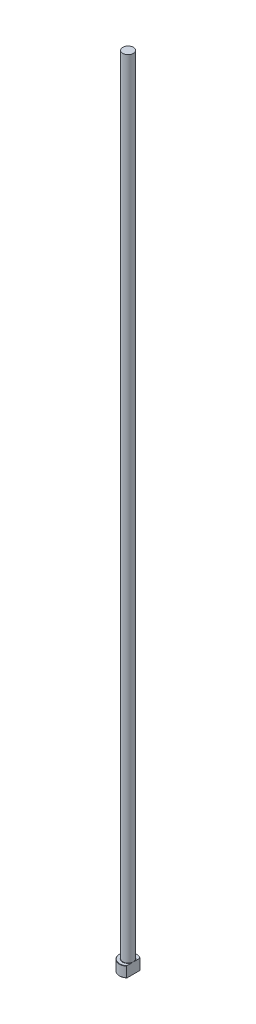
ISO-10303-21;
HEADER;
FILE_DESCRIPTION(('STEP AP214'),'2;1');
FILE_NAME('part.step','',(''),(''),'','','');
FILE_SCHEMA(('AUTOMOTIVE_DESIGN { 1 0 10303 214 1 1 1 1 }'));
ENDSEC;
DATA;
#1=APPLICATION_CONTEXT('core data for automotive mechanical design processes');
#2=APPLICATION_PROTOCOL_DEFINITION('international standard','automotive_design',2000,#1);
#3=PRODUCT_CONTEXT('',#1,'mechanical');
#4=PRODUCT('Part','Part','',(#3));
#5=PRODUCT_RELATED_PRODUCT_CATEGORY('part','',(#4));
#6=PRODUCT_DEFINITION_FORMATION('','',#4);
#7=PRODUCT_DEFINITION_CONTEXT('part definition',#1,'design');
#8=PRODUCT_DEFINITION('design','',#6,#7);
#9=PRODUCT_DEFINITION_SHAPE('','',#8);
#10=(LENGTH_UNIT() NAMED_UNIT(*) SI_UNIT(.MILLI.,.METRE.));
#11=(NAMED_UNIT(*) PLANE_ANGLE_UNIT() SI_UNIT($,.RADIAN.));
#12=(NAMED_UNIT(*) SI_UNIT($,.STERADIAN.) SOLID_ANGLE_UNIT());
#13=UNCERTAINTY_MEASURE_WITH_UNIT(LENGTH_MEASURE(1.E-05),#10,'distance_accuracy_value','');
#14=(GEOMETRIC_REPRESENTATION_CONTEXT(3) GLOBAL_UNCERTAINTY_ASSIGNED_CONTEXT((#13)) GLOBAL_UNIT_ASSIGNED_CONTEXT((#10,
#11,#12)) REPRESENTATION_CONTEXT('',''));
#15=CARTESIAN_POINT('',(0.,0.,0.));
#16=DIRECTION('',(0.,0.,1.));
#17=DIRECTION('',(1.,0.,0.));
#18=AXIS2_PLACEMENT_3D('',#15,#16,#17);
#19=CARTESIAN_POINT('',(0.,0.,0.));
#20=DIRECTION('',(0.,-1.,0.));
#21=DIRECTION('',(0.,0.,-1.));
#22=AXIS2_PLACEMENT_3D('',#19,#20,#21);
#23=PLANE('',#22);
#24=CARTESIAN_POINT('',(0.,0.,0.));
#25=DIRECTION('',(0.,-1.,0.));
#26=DIRECTION('',(0.,0.,-1.));
#27=AXIS2_PLACEMENT_3D('',#24,#25,#26);
#28=CIRCLE('',#27,6.29999999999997);
#29=CARTESIAN_POINT('',(3.99999999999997,0.,4.86723740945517));
#30=VERTEX_POINT('',#29);
#31=CARTESIAN_POINT('',(3.99999999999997,0.,-4.86723740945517));
#32=VERTEX_POINT('',#31);
#33=EDGE_CURVE('E98',#30,#32,#28,.T.);
#34=ORIENTED_EDGE('',*,*,#33,.T.);
#35=DIRECTION('',(0.,0.,1.));
#36=VECTOR('',#35,1.);
#37=CARTESIAN_POINT('',(3.99999999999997,0.,5.12347538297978));
#38=LINE('',#37,#36);
#39=EDGE_CURVE('E83',#32,#30,#38,.T.);
#40=ORIENTED_EDGE('',*,*,#39,.T.);
#41=EDGE_LOOP('',(#34,#40));
#42=FACE_BOUND('',#41,.T.);
#43=ADVANCED_FACE('F32',(#42),#23,.T.);
#44=CARTESIAN_POINT('',(0.,259.958771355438,0.));
#45=DIRECTION('',(0.,1.,0.));
#46=DIRECTION('',(0.,0.,1.));
#47=AXIS2_PLACEMENT_3D('',#44,#45,#46);
#48=CYLINDRICAL_SURFACE('',#47,6.49999999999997);
#49=CARTESIAN_POINT('',(0.,7.79999999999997,0.));
#50=DIRECTION('',(0.,1.,0.));
#51=DIRECTION('',(0.,0.,1.));
#52=AXIS2_PLACEMENT_3D('',#49,#50,#51);
#53=CIRCLE('',#52,6.49999999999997);
#54=CARTESIAN_POINT('',(3.99999999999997,7.79999999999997,5.12347538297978));
#55=VERTEX_POINT('',#54);
#56=CARTESIAN_POINT('',(3.99999999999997,7.79999999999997,-5.12347538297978));
#57=VERTEX_POINT('',#56);
#58=EDGE_CURVE('E104',#55,#57,#53,.F.);
#59=ORIENTED_EDGE('',*,*,#58,.T.);
#60=DIRECTION('',(0.,-1.,0.));
#61=VECTOR('',#60,1.);
#62=CARTESIAN_POINT('',(3.99999999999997,600.,-5.12347538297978));
#63=LINE('',#62,#61);
#64=CARTESIAN_POINT('',(3.99999999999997,0.200000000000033,-5.12347538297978));
#65=VERTEX_POINT('',#64);
#66=EDGE_CURVE('E183',#57,#65,#63,.T.);
#67=ORIENTED_EDGE('',*,*,#66,.T.);
#68=CARTESIAN_POINT('',(0.,0.200000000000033,0.));
#69=DIRECTION('',(0.,-1.,0.));
#70=DIRECTION('',(0.,0.,-1.));
#71=AXIS2_PLACEMENT_3D('',#68,#69,#70);
#72=CIRCLE('',#71,6.49999999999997);
#73=CARTESIAN_POINT('',(3.99999999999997,0.200000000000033,5.12347538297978));
#74=VERTEX_POINT('',#73);
#75=EDGE_CURVE('E100',#65,#74,#72,.F.);
#76=ORIENTED_EDGE('',*,*,#75,.T.);
#77=DIRECTION('',(0.,-1.,0.));
#78=VECTOR('',#77,1.);
#79=CARTESIAN_POINT('',(3.99999999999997,600.,5.12347538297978));
#80=LINE('',#79,#78);
#81=EDGE_CURVE('E93',#55,#74,#80,.T.);
#82=ORIENTED_EDGE('',*,*,#81,.F.);
#83=EDGE_LOOP('',(#59,#67,#76,#82));
#84=FACE_BOUND('',#83,.T.);
#85=ADVANCED_FACE('F158',(#84),#48,.T.);
#86=CARTESIAN_POINT('',(-6.49999999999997,8.,0.));
#87=DIRECTION('',(0.,1.,0.));
#88=DIRECTION('',(0.,0.,1.));
#89=AXIS2_PLACEMENT_3D('',#86,#87,#88);
#90=PLANE('',#89);
#91=CARTESIAN_POINT('',(0.,8.,0.));
#92=DIRECTION('',(0.,1.,0.));
#93=DIRECTION('',(0.,0.,1.));
#94=AXIS2_PLACEMENT_3D('',#91,#92,#93);
#95=CIRCLE('',#94,6.29999999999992);
#96=CARTESIAN_POINT('',(3.99999999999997,8.,-4.86723740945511));
#97=VERTEX_POINT('',#96);
#98=CARTESIAN_POINT('',(3.99999999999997,8.,4.86723740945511));
#99=VERTEX_POINT('',#98);
#100=EDGE_CURVE('E178',#97,#99,#95,.T.);
#101=ORIENTED_EDGE('',*,*,#100,.T.);
#102=DIRECTION('',(0.,0.,-1.));
#103=VECTOR('',#102,1.);
#104=CARTESIAN_POINT('',(3.99999999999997,8.,0.));
#105=LINE('',#104,#103);
#106=CARTESIAN_POINT('',(3.99999999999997,7.99999999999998,1.28062484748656));
#107=VERTEX_POINT('',#106);
#108=EDGE_CURVE('E57',#99,#107,#105,.T.);
#109=ORIENTED_EDGE('',*,*,#108,.T.);
#110=CARTESIAN_POINT('',(0.,8.,0.));
#111=DIRECTION('',(0.,1.,0.));
#112=DIRECTION('',(0.,0.,1.));
#113=AXIS2_PLACEMENT_3D('',#110,#111,#112);
#114=CIRCLE('',#113,4.19999999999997);
#115=CARTESIAN_POINT('',(3.99999999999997,7.99999999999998,-1.28062484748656));
#116=VERTEX_POINT('',#115);
#117=EDGE_CURVE('E107',#107,#116,#114,.F.);
#118=ORIENTED_EDGE('',*,*,#117,.T.);
#119=EDGE_CURVE('E136',#116,#97,#105,.T.);
#120=ORIENTED_EDGE('',*,*,#119,.T.);
#121=EDGE_LOOP('',(#101,#109,#118,#120));
#122=FACE_BOUND('',#121,.T.);
#123=ADVANCED_FACE('F147',(#122),#90,.T.);
#124=CARTESIAN_POINT('',(0.,8.00000000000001,0.));
#125=DIRECTION('',(0.,-1.,0.));
#126=DIRECTION('',(0.,0.,-1.));
#127=AXIS2_PLACEMENT_3D('',#124,#125,#126);
#128=CONICAL_SURFACE('',#127,6.29999999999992,0.785398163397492);
#129=ORIENTED_EDGE('',*,*,#58,.F.);
#130=CARTESIAN_POINT('',(3.99999999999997,2.33835680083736,11.2730168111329));
#131=CARTESIAN_POINT('',(3.99999999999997,2.50751109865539,11.0935258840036));
#132=CARTESIAN_POINT('',(3.99999999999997,2.6764300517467,10.9138129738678));
#133=CARTESIAN_POINT('',(3.99999999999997,3.01371694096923,10.5538688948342));
#134=CARTESIAN_POINT('',(3.99999999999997,3.18208487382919,10.3736377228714));
#135=CARTESIAN_POINT('',(3.99999999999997,3.68651578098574,9.83176085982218));
#136=CARTESIAN_POINT('',(3.99999999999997,4.02162663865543,9.46922758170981));
#137=CARTESIAN_POINT('',(3.99999999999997,4.6983926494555,8.73004878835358));
#138=CARTESIAN_POINT('',(3.99999999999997,5.03994227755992,8.35330632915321));
#139=CARTESIAN_POINT('',(3.99999999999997,5.54813444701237,7.78474717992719));
#140=CARTESIAN_POINT('',(3.99999999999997,5.71678224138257,7.59472329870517));
#141=CARTESIAN_POINT('',(3.99999999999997,6.05243048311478,7.21322727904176));
#142=CARTESIAN_POINT('',(3.99999999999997,6.21943094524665,7.02175515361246));
#143=CARTESIAN_POINT('',(3.99999999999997,6.55125779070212,6.63720143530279));
#144=CARTESIAN_POINT('',(3.99999999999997,6.71608581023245,6.44412125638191));
#145=CARTESIAN_POINT('',(3.99999999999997,7.04317390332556,6.05578163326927));
#146=CARTESIAN_POINT('',(3.99999999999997,7.20543388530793,5.86052211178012));
#147=CARTESIAN_POINT('',(3.99999999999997,7.52702721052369,5.46681806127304));
#148=CARTESIAN_POINT('',(3.99999999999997,7.68635259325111,5.26836701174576));
#149=CARTESIAN_POINT('',(3.99999999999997,8.00060742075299,4.86803282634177));
#150=CARTESIAN_POINT('',(3.99999999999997,8.15553731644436,4.66615004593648));
#151=CARTESIAN_POINT('',(3.99999999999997,8.45751575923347,4.26060182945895));
#152=CARTESIAN_POINT('',(3.99999999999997,8.60464039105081,4.05699334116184));
#153=CARTESIAN_POINT('',(3.99999999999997,8.89099959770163,3.64409822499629));
#154=CARTESIAN_POINT('',(3.99999999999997,9.03023022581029,3.43480883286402));
#155=CARTESIAN_POINT('',(3.99999999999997,9.29677357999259,3.00991388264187));
#156=CARTESIAN_POINT('',(3.99999999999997,9.42413322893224,2.79433803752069));
#157=CARTESIAN_POINT('',(3.99999999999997,9.66227069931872,2.35430355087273));
#158=CARTESIAN_POINT('',(3.99999999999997,9.77306978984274,2.12985677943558));
#159=CARTESIAN_POINT('',(3.99999999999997,9.92324174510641,1.77981866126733));
#160=CARTESIAN_POINT('',(3.99999999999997,9.97150219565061,1.65804958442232));
#161=CARTESIAN_POINT('',(3.99999999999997,10.0598239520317,1.41150602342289));
#162=CARTESIAN_POINT('',(3.99999999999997,10.099883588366,1.28673093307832));
#163=CARTESIAN_POINT('',(3.99999999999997,10.1699893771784,1.03512545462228));
#164=CARTESIAN_POINT('',(3.99999999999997,10.2000910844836,0.908310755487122));
#165=CARTESIAN_POINT('',(3.99999999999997,10.2490705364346,0.652511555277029));
#166=CARTESIAN_POINT('',(3.99999999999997,10.2679495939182,0.523527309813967));
#167=CARTESIAN_POINT('',(3.99999999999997,10.2934980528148,0.262809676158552));
#168=CARTESIAN_POINT('',(3.99999999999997,10.3000223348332,0.131061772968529));
#169=CARTESIAN_POINT('',(3.99999999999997,10.2999775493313,-0.132423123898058));
#170=CARTESIAN_POINT('',(3.99999999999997,10.2934092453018,-0.264160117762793));
#171=CARTESIAN_POINT('',(3.99999999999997,10.2675780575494,-0.526867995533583));
#172=CARTESIAN_POINT('',(3.99999999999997,10.2482669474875,-0.657834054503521));
#173=CARTESIAN_POINT('',(3.99999999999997,10.1980980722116,-0.917527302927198));
#174=CARTESIAN_POINT('',(3.99999999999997,10.1672371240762,-1.04625386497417));
#175=CARTESIAN_POINT('',(3.99999999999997,10.0805844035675,-1.35405733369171));
#176=CARTESIAN_POINT('',(3.99999999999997,10.0197633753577,-1.5317103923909));
#177=CARTESIAN_POINT('',(3.99999999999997,9.88274788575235,-1.88095872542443));
#178=CARTESIAN_POINT('',(3.99999999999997,9.80654370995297,-2.0525500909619));
#179=CARTESIAN_POINT('',(3.99999999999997,9.68319777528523,-2.30659899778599));
#180=CARTESIAN_POINT('',(3.99999999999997,9.64031955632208,-2.39117275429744));
#181=CARTESIAN_POINT('',(3.99999999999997,9.55202002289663,-2.55898629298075));
#182=CARTESIAN_POINT('',(3.99999999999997,9.50659867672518,-2.642226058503));
#183=CARTESIAN_POINT('',(3.99999999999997,9.41358656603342,-2.80743574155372));
#184=CARTESIAN_POINT('',(3.99999999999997,9.36599667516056,-2.8894061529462));
#185=CARTESIAN_POINT('',(3.99999999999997,9.26892422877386,-3.05220990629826));
#186=CARTESIAN_POINT('',(3.99999999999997,9.2194417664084,-3.13304330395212));
#187=CARTESIAN_POINT('',(3.99999999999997,9.04529267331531,-3.41112924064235));
#188=CARTESIAN_POINT('',(3.99999999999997,8.91648308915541,-3.60579191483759));
#189=CARTESIAN_POINT('',(3.99999999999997,8.6517561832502,-3.99024288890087));
#190=CARTESIAN_POINT('',(3.99999999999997,8.51583685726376,-4.18002979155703));
#191=CARTESIAN_POINT('',(3.99999999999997,8.23863283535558,-4.55590680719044));
#192=CARTESIAN_POINT('',(3.99999999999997,8.09734319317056,-4.74199325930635));
#193=CARTESIAN_POINT('',(3.99999999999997,7.81082146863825,-5.11106130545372));
#194=CARTESIAN_POINT('',(3.99999999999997,7.66558980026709,-5.29404322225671));
#195=CARTESIAN_POINT('',(3.99999999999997,7.37148704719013,-5.65825720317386));
#196=CARTESIAN_POINT('',(3.99999999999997,7.22260377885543,-5.83947940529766));
#197=CARTESIAN_POINT('',(3.99999999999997,6.92240731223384,-6.19990198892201));
#198=CARTESIAN_POINT('',(3.99999999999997,6.77109406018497,-6.3791023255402));
#199=CARTESIAN_POINT('',(3.99999999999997,6.3144319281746,-6.91404380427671));
#200=CARTESIAN_POINT('',(3.99999999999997,6.00619978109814,-7.26732233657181));
#201=CARTESIAN_POINT('',(3.99999999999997,5.42019779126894,-7.92915827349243));
#202=CARTESIAN_POINT('',(3.99999999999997,5.14297898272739,-8.23820650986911));
#203=CARTESIAN_POINT('',(3.99999999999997,4.58554936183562,-8.85367584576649));
#204=CARTESIAN_POINT('',(3.99999999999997,4.30533810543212,-9.16009654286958));
#205=CARTESIAN_POINT('',(3.99999999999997,3.74491435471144,-9.76850943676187));
#206=CARTESIAN_POINT('',(3.99999999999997,3.46471907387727,-10.0705175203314));
#207=CARTESIAN_POINT('',(3.99999999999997,2.90267484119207,-10.6728856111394));
#208=CARTESIAN_POINT('',(3.99999999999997,2.6208262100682,-10.9732459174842));
#209=CARTESIAN_POINT('',(3.99999999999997,2.33835680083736,-11.2730168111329));
#210=B_SPLINE_CURVE_WITH_KNOTS('',3,(#130,#131,#132,#133,#134,#135,#136,#137,#138,#139,#140,
#141,#142,#143,#144,#145,#146,#147,#148,#149,#150,#151,#152,#153,#154,#155,#156,#157,#158,#159,
#160,#161,#162,#163,#164,#165,#166,#167,#168,#169,#170,#171,#172,#173,#174,#175,#176,#177,#178,
#179,#180,#181,#182,#183,#184,#185,#186,#187,#188,#189,#190,#191,#192,#193,#194,#195,#196,#197,
#198,#199,#200,#201,#202,#203,#204,#205,#206,#207,#208,#209),.UNSPECIFIED.,.F.,.F.,(4,2,2,2,2,2,
2,2,2,2,2,2,2,2,2,2,2,2,2,2,2,2,2,2,2,2,2,2,2,2,2,2,2,2,2,2,2,2,2,4),(0.,0.739913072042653,
1.47983052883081,2.96088564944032,4.486400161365,5.24860048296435,6.0107939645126,
6.77237616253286,7.53398545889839,8.29742301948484,9.06078197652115,9.8142547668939,
10.5681010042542,11.3188284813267,12.0685833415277,12.4613034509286,12.854103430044,
13.2446735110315,13.6351978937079,14.0302815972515,14.4253422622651,14.8219067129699,
15.218580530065,15.7809161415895,16.3436079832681,16.6280404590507,16.9124764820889,
17.1967989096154,17.481107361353,18.1811169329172,18.8813249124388,19.5821942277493,
20.2829902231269,20.9865751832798,21.6901757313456,23.0966141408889,24.3420866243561,
25.5877465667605,26.8236460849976,28.0593133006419),.UNSPECIFIED.);
#211=EDGE_CURVE('E135',#55,#99,#210,.T.);
#212=ORIENTED_EDGE('',*,*,#211,.T.);
#213=ORIENTED_EDGE('',*,*,#100,.F.);
#214=EDGE_CURVE('E127',#97,#57,#210,.T.);
#215=ORIENTED_EDGE('',*,*,#214,.T.);
#216=EDGE_LOOP('',(#129,#212,#213,#215));
#217=FACE_BOUND('',#216,.T.);
#218=ADVANCED_FACE('F143',(#217),#128,.T.);
#219=CARTESIAN_POINT('',(0.,0.200000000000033,0.));
#220=DIRECTION('',(0.,1.,0.));
#221=DIRECTION('',(0.,0.,1.));
#222=AXIS2_PLACEMENT_3D('',#219,#220,#221);
#223=CONICAL_SURFACE('',#222,6.49999999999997,0.785398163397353);
#224=ORIENTED_EDGE('',*,*,#75,.F.);
#225=CARTESIAN_POINT('',(3.99999999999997,5.66164319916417,-11.2730168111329));
#226=CARTESIAN_POINT('',(3.99999999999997,5.4924889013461,-11.0935258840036));
#227=CARTESIAN_POINT('',(3.99999999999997,5.32356994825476,-10.9138129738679));
#228=CARTESIAN_POINT('',(3.99999999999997,4.98628305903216,-10.5538688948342));
#229=CARTESIAN_POINT('',(3.99999999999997,4.81791512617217,-10.3736377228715));
#230=CARTESIAN_POINT('',(3.99999999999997,4.31348421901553,-9.8317608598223));
#231=CARTESIAN_POINT('',(3.99999999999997,3.97837336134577,-9.46922758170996));
#232=CARTESIAN_POINT('',(3.99999999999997,3.30160735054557,-8.7300487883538));
#233=CARTESIAN_POINT('',(3.99999999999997,2.96005772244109,-8.35330632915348));
#234=CARTESIAN_POINT('',(3.99999999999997,2.45186555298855,-7.78474717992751));
#235=CARTESIAN_POINT('',(3.99999999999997,2.28321775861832,-7.59472329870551));
#236=CARTESIAN_POINT('',(3.99999999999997,1.94756951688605,-7.21322727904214));
#237=CARTESIAN_POINT('',(3.99999999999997,1.78056905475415,-7.02175515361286));
#238=CARTESIAN_POINT('',(3.99999999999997,1.44874220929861,-6.63720143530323));
#239=CARTESIAN_POINT('',(3.99999999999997,1.28391418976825,-6.44412125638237));
#240=CARTESIAN_POINT('',(3.99999999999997,0.95682609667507,-6.05578163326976));
#241=CARTESIAN_POINT('',(3.99999999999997,0.794566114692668,-5.86052211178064));
#242=CARTESIAN_POINT('',(3.99999999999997,0.472972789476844,-5.4668180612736));
#243=CARTESIAN_POINT('',(3.99999999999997,0.313647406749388,-5.26836701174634));
#244=CARTESIAN_POINT('',(3.99999999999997,-0.000607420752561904,-4.86803282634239));
#245=CARTESIAN_POINT('',(3.99999999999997,-0.155537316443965,-4.66615004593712));
#246=CARTESIAN_POINT('',(3.99999999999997,-0.457515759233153,-4.26060182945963));
#247=CARTESIAN_POINT('',(3.99999999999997,-0.604640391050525,-4.05699334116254));
#248=CARTESIAN_POINT('',(3.99999999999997,-0.890999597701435,-3.64409822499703));
#249=CARTESIAN_POINT('',(3.99999999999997,-1.03023022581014,-3.43480883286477));
#250=CARTESIAN_POINT('',(3.99999999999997,-1.29677357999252,-3.00991388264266));
#251=CARTESIAN_POINT('',(3.99999999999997,-1.42413322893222,-2.7943380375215));
#252=CARTESIAN_POINT('',(3.99999999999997,-1.6622706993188,-2.35430355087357));
#253=CARTESIAN_POINT('',(3.99999999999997,-1.77306978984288,-2.12985677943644));
#254=CARTESIAN_POINT('',(3.99999999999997,-1.92324174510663,-1.77981866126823));
#255=CARTESIAN_POINT('',(3.99999999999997,-1.97150219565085,-1.65804958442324));
#256=CARTESIAN_POINT('',(3.99999999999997,-2.05982395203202,-1.41150602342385));
#257=CARTESIAN_POINT('',(3.99999999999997,-2.09988358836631,-1.2867309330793));
#258=CARTESIAN_POINT('',(3.99999999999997,-2.16998937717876,-1.0351254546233));
#259=CARTESIAN_POINT('',(3.99999999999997,-2.20009108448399,-0.908310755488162));
#260=CARTESIAN_POINT('',(3.99999999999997,-2.24907053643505,-0.652511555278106));
#261=CARTESIAN_POINT('',(3.99999999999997,-2.26794959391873,-0.523527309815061));
#262=CARTESIAN_POINT('',(3.99999999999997,-2.29349805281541,-0.262809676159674));
#263=CARTESIAN_POINT('',(3.99999999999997,-2.30002233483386,-0.131061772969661));
#264=CARTESIAN_POINT('',(3.99999999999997,-2.29997754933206,0.13242312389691));
#265=CARTESIAN_POINT('',(3.99999999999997,-2.29340924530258,0.264160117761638));
#266=CARTESIAN_POINT('',(3.99999999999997,-2.26757805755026,0.526867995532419));
#267=CARTESIAN_POINT('',(3.99999999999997,-2.24826694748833,0.657834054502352));
#268=CARTESIAN_POINT('',(3.99999999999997,-2.19809807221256,0.917527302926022));
#269=CARTESIAN_POINT('',(3.99999999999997,-2.16723712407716,1.04625386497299));
#270=CARTESIAN_POINT('',(3.99999999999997,-2.08058440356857,1.35405733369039));
#271=CARTESIAN_POINT('',(3.99999999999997,-2.01976337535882,1.53171039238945));
#272=CARTESIAN_POINT('',(3.99999999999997,-1.88274788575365,1.88095872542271));
#273=CARTESIAN_POINT('',(3.99999999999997,-1.80654370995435,2.05255009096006));
#274=CARTESIAN_POINT('',(3.99999999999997,-1.68319777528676,2.30659899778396));
#275=CARTESIAN_POINT('',(3.99999999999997,-1.64031955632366,2.39117275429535));
#276=CARTESIAN_POINT('',(3.99999999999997,-1.55202002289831,2.55898629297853));
#277=CARTESIAN_POINT('',(3.99999999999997,-1.5065986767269,2.64222605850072));
#278=CARTESIAN_POINT('',(3.99999999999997,-1.41358656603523,2.80743574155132));
#279=CARTESIAN_POINT('',(3.99999999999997,-1.36599667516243,2.88940615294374));
#280=CARTESIAN_POINT('',(3.99999999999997,-1.26892422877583,3.05220990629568));
#281=CARTESIAN_POINT('',(3.99999999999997,-1.21944176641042,3.13304330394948));
#282=CARTESIAN_POINT('',(3.99999999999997,-1.04529267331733,3.41112924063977));
#283=CARTESIAN_POINT('',(3.99999999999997,-0.916483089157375,3.60579191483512));
#284=CARTESIAN_POINT('',(3.99999999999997,-0.651756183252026,3.99024288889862));
#285=CARTESIAN_POINT('',(3.99999999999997,-0.515836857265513,4.18002979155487));
#286=CARTESIAN_POINT('',(3.99999999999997,-0.23863283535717,4.55590680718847));
#287=CARTESIAN_POINT('',(3.99999999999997,-0.0973431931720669,4.74199325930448));
#288=CARTESIAN_POINT('',(3.99999999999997,0.189178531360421,5.11106130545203));
#289=CARTESIAN_POINT('',(3.99999999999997,0.334410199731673,5.2940432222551));
#290=CARTESIAN_POINT('',(3.99999999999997,0.628512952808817,5.65825720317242));
#291=CARTESIAN_POINT('',(3.99999999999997,0.777396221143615,5.83947940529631));
#292=CARTESIAN_POINT('',(3.99999999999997,1.07759268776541,6.19990198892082));
#293=CARTESIAN_POINT('',(3.99999999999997,1.22890593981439,6.37910232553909));
#294=CARTESIAN_POINT('',(3.99999999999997,1.68556807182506,6.91404380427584));
#295=CARTESIAN_POINT('',(3.99999999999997,1.99380021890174,7.26732233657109));
#296=CARTESIAN_POINT('',(3.99999999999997,2.57980220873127,7.92915827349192));
#297=CARTESIAN_POINT('',(3.99999999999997,2.85702101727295,8.23820650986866));
#298=CARTESIAN_POINT('',(3.99999999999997,3.41445063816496,8.85367584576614));
#299=CARTESIAN_POINT('',(3.99999999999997,3.69466189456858,9.16009654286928));
#300=CARTESIAN_POINT('',(3.99999999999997,4.2550856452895,9.76850943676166));
#301=CARTESIAN_POINT('',(3.99999999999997,4.53528092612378,10.0705175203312));
#302=CARTESIAN_POINT('',(3.99999999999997,5.09732515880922,10.6728856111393));
#303=CARTESIAN_POINT('',(3.99999999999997,5.37917378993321,10.9732459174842));
#304=CARTESIAN_POINT('',(3.99999999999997,5.66164319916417,11.2730168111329));
#305=B_SPLINE_CURVE_WITH_KNOTS('',3,(#225,#226,#227,#228,#229,#230,#231,#232,#233,#234,#235,
#236,#237,#238,#239,#240,#241,#242,#243,#244,#245,#246,#247,#248,#249,#250,#251,#252,#253,#254,
#255,#256,#257,#258,#259,#260,#261,#262,#263,#264,#265,#266,#267,#268,#269,#270,#271,#272,#273,
#274,#275,#276,#277,#278,#279,#280,#281,#282,#283,#284,#285,#286,#287,#288,#289,#290,#291,#292,
#293,#294,#295,#296,#297,#298,#299,#300,#301,#302,#303,#304),.UNSPECIFIED.,.F.,.F.,(4,2,2,2,2,2,
2,2,2,2,2,2,2,2,2,2,2,2,2,2,2,2,2,2,2,2,2,2,2,2,2,2,2,2,2,2,2,2,2,4),(0.,0.739913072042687,
1.47983052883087,2.96088564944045,4.48640016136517,5.24860048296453,6.0107939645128,
6.77237616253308,7.53398545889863,8.29742301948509,9.06078197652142,9.81425476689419,
10.5681010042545,11.3188284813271,12.0685833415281,12.4613034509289,12.8541034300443,
13.2446735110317,13.6351978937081,14.0302815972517,14.4253422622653,14.8219067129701,
15.2185805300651,15.7809161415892,16.3436079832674,16.6280404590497,16.9124764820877,
17.196798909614,17.4811073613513,18.1811169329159,18.8813249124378,19.5821942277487,
20.2829902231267,20.98657518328,21.6901757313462,23.0966141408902,24.3420866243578,
25.5877465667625,26.823646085,28.0593133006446),.UNSPECIFIED.);
#306=EDGE_CURVE('E86',#65,#32,#305,.T.);
#307=ORIENTED_EDGE('',*,*,#306,.T.);
#308=ORIENTED_EDGE('',*,*,#33,.F.);
#309=EDGE_CURVE('E89',#30,#74,#305,.T.);
#310=ORIENTED_EDGE('',*,*,#309,.T.);
#311=EDGE_LOOP('',(#224,#307,#308,#310));
#312=FACE_BOUND('',#311,.T.);
#313=ADVANCED_FACE('F97',(#312),#223,.T.);
#314=CARTESIAN_POINT('',(0.,8.19999999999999,0.));
#315=DIRECTION('',(0.,1.,0.));
#316=DIRECTION('',(0.,0.,1.));
#317=AXIS2_PLACEMENT_3D('',#314,#315,#316);
#318=TOROIDAL_SURFACE('',#317,4.19999999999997,0.2);
#319=CARTESIAN_POINT('',(3.99999999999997,8.19999999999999,0.));
#320=CARTESIAN_POINT('',(3.99999999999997,8.20000051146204,6.54993054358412E-12));
#321=CARTESIAN_POINT('',(3.99999999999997,8.20000102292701,-2.33849533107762E-07));
#322=CARTESIAN_POINT('',(3.99999999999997,8.20000197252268,-8.59106931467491E-07));
#323=CARTESIAN_POINT('',(3.99999999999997,8.20000239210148,-1.26721109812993E-06));
#324=CARTESIAN_POINT('',(3.99999999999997,8.20000328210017,-2.25074280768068E-06));
#325=CARTESIAN_POINT('',(3.99999999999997,8.20000373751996,-2.84212519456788E-06));
#326=CARTESIAN_POINT('',(3.99999999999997,8.20000453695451,-4.05328052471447E-06));
#327=CARTESIAN_POINT('',(3.99999999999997,8.20000488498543,-4.67066382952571E-06));
#328=CARTESIAN_POINT('',(3.99999999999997,8.20000621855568,-7.11716611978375E-06));
#329=CARTESIAN_POINT('',(3.99999999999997,8.20000713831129,-8.98558487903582E-06));
#330=CARTESIAN_POINT('',(3.99999999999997,8.20000861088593,-1.26418243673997E-05));
#331=CARTESIAN_POINT('',(3.99999999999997,8.2000091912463,-1.44189480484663E-05));
#332=CARTESIAN_POINT('',(3.99999999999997,8.20001169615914,-2.20915838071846E-05));
#333=CARTESIAN_POINT('',(3.99999999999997,8.20001361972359,-2.79894750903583E-05));
#334=CARTESIAN_POINT('',(3.99999999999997,8.20001638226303,-3.90228536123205E-05));
#335=CARTESIAN_POINT('',(3.99999999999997,8.20001734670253,-4.41264580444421E-05));
#336=CARTESIAN_POINT('',(3.99999999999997,8.20002447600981,-8.24800902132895E-05));
#337=CARTESIAN_POINT('',(3.99999999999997,8.20003000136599,-0.000115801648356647));
#338=CARTESIAN_POINT('',(3.99999999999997,8.2000541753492,-0.000248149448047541));
#339=CARTESIAN_POINT('',(3.99999999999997,8.200077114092,-0.000346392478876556));
#340=CARTESIAN_POINT('',(3.99999999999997,8.20016695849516,-0.000737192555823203));
#341=CARTESIAN_POINT('',(3.99999999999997,8.20023118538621,-0.00103015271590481));
#342=CARTESIAN_POINT('',(3.99999999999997,8.20048943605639,-0.00220000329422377));
#343=CARTESIAN_POINT('',(3.99999999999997,8.20068689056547,-0.00307635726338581));
#344=CARTESIAN_POINT('',(3.99999999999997,8.20151245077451,-0.00674945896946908));
#345=CARTESIAN_POINT('',(3.99999999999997,8.20213623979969,-0.00954688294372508));
#346=CARTESIAN_POINT('',(3.99999999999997,8.21069858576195,-0.0479346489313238));
#347=CARTESIAN_POINT('',(3.99999999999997,8.21866411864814,-0.0835210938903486));
#348=CARTESIAN_POINT('',(3.99999999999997,8.23536251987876,-0.158673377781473));
#349=CARTESIAN_POINT('',(3.99999999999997,8.24408230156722,-0.198242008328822));
#350=CARTESIAN_POINT('',(3.99999999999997,8.25875222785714,-0.265746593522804));
#351=CARTESIAN_POINT('',(3.99999999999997,8.26476038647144,-0.293669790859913));
#352=CARTESIAN_POINT('',(3.99999999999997,8.27645424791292,-0.348796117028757));
#353=CARTESIAN_POINT('',(3.99999999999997,8.28214427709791,-0.375998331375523));
#354=CARTESIAN_POINT('',(3.99999999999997,8.30043795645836,-0.465036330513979));
#355=CARTESIAN_POINT('',(3.99999999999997,8.31263876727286,-0.526956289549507));
#356=CARTESIAN_POINT('',(3.99999999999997,8.33561275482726,-0.65168218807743));
#357=CARTESIAN_POINT('',(3.99999999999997,8.34637105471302,-0.714490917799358));
#358=CARTESIAN_POINT('',(3.99999999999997,8.36658245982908,-0.846543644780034));
#359=CARTESIAN_POINT('',(3.99999999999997,8.37580902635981,-0.915823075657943));
#360=CARTESIAN_POINT('',(3.99999999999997,8.39039845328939,-1.05460878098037));
#361=CARTESIAN_POINT('',(3.99999999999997,8.39577328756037,-1.1241136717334));
#362=CARTESIAN_POINT('',(3.99999999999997,8.39959291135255,-1.22750409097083));
#363=CARTESIAN_POINT('',(3.99999999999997,8.40018074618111,-1.26130913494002));
#364=CARTESIAN_POINT('',(3.99999999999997,8.39972074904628,-1.32890426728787));
#365=CARTESIAN_POINT('',(3.99999999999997,8.39867346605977,-1.36269435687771));
#366=CARTESIAN_POINT('',(3.99999999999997,8.3945557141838,-1.42954089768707));
#367=CARTESIAN_POINT('',(3.99999999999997,8.39152235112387,-1.46259952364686));
#368=CARTESIAN_POINT('',(3.99999999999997,8.38286512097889,-1.52835908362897));
#369=CARTESIAN_POINT('',(3.99999999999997,8.37724516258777,-1.56106048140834));
#370=CARTESIAN_POINT('',(3.99999999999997,8.36402263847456,-1.61846409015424));
#371=CARTESIAN_POINT('',(3.99999999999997,8.3571375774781,-1.64332989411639));
#372=CARTESIAN_POINT('',(3.99999999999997,8.3402719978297,-1.69212725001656));
#373=CARTESIAN_POINT('',(3.99999999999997,8.33028876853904,-1.71605796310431));
#374=CARTESIAN_POINT('',(3.99999999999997,8.31168601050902,-1.75008824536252));
#375=CARTESIAN_POINT('',(3.99999999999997,8.30485398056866,-1.76115159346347));
#376=CARTESIAN_POINT('',(3.99999999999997,8.28960114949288,-1.78210611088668));
#377=CARTESIAN_POINT('',(3.99999999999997,8.28118962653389,-1.79200360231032));
#378=CARTESIAN_POINT('',(3.99999999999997,8.26737388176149,-1.80493475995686));
#379=CARTESIAN_POINT('',(3.99999999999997,8.26276322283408,-1.80881084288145));
#380=CARTESIAN_POINT('',(3.99999999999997,8.25306023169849,-1.81592390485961));
#381=CARTESIAN_POINT('',(3.99999999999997,8.24796771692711,-1.81916064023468));
#382=CARTESIAN_POINT('',(3.99999999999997,8.237244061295,-1.8248051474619));
#383=CARTESIAN_POINT('',(3.99999999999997,8.23160666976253,-1.82720134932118));
#384=CARTESIAN_POINT('',(3.99999999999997,8.21997194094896,-1.8308361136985));
#385=CARTESIAN_POINT('',(3.99999999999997,8.21397550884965,-1.83207746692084));
#386=CARTESIAN_POINT('',(3.99999999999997,8.20263132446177,-1.83315692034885));
#387=CARTESIAN_POINT('',(3.99999999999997,8.19729868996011,-1.8331541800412));
#388=CARTESIAN_POINT('',(3.99999999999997,8.18672944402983,-1.83214057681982));
#389=CARTESIAN_POINT('',(3.99999999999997,8.18149289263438,-1.83112910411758));
#390=CARTESIAN_POINT('',(3.99999999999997,8.17078487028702,-1.82806907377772));
#391=CARTESIAN_POINT('',(3.99999999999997,8.16533999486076,-1.82592931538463));
#392=CARTESIAN_POINT('',(3.99999999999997,8.15487296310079,-1.82079411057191));
#393=CARTESIAN_POINT('',(3.99999999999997,8.14985146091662,-1.81779737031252));
#394=CARTESIAN_POINT('',(3.99999999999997,8.13773920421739,-1.80942140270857));
#395=CARTESIAN_POINT('',(3.99999999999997,8.13094534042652,-1.80361715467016));
#396=CARTESIAN_POINT('',(3.99999999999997,8.11830005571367,-1.79106454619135));
#397=CARTESIAN_POINT('',(3.99999999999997,8.11245134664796,-1.78431356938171));
#398=CARTESIAN_POINT('',(3.99999999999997,8.09656788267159,-1.76377799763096));
#399=CARTESIAN_POINT('',(3.99999999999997,8.08757958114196,-1.7491934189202));
#400=CARTESIAN_POINT('',(3.99999999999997,8.07165230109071,-1.71899459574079));
#401=CARTESIAN_POINT('',(3.99999999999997,8.06471615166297,-1.70337896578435));
#402=CARTESIAN_POINT('',(3.99999999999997,8.0496464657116,-1.66459665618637));
#403=CARTESIAN_POINT('',(3.99999999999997,8.04232016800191,-1.64111968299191));
#404=CARTESIAN_POINT('',(3.99999999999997,8.02986383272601,-1.59357415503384));
#405=CARTESIAN_POINT('',(3.99999999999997,8.02473853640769,-1.56950444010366));
#406=CARTESIAN_POINT('',(3.99999999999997,8.01610324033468,-1.52067485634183));
#407=CARTESIAN_POINT('',(3.99999999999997,8.01262117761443,-1.49591014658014));
#408=CARTESIAN_POINT('',(3.99999999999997,8.00704256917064,-1.44626562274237));
#409=CARTESIAN_POINT('',(3.99999999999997,8.00494421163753,-1.42138600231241));
#410=CARTESIAN_POINT('',(3.99999999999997,8.00075077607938,-1.35341124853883));
#411=CARTESIAN_POINT('',(3.99999999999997,7.99977133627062,-1.31024782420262));
#412=CARTESIAN_POINT('',(3.99999999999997,8.00031303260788,-1.22392963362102));
#413=CARTESIAN_POINT('',(3.99999999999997,8.00183577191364,-1.18077489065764));
#414=CARTESIAN_POINT('',(3.99999999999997,8.00931890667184,-1.05109835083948));
#415=CARTESIAN_POINT('',(3.99999999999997,8.01820648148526,-0.964749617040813));
#416=CARTESIAN_POINT('',(3.99999999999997,8.03989342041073,-0.80020089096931));
#417=CARTESIAN_POINT('',(3.99999999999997,8.05228816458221,-0.72194180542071));
#418=CARTESIAN_POINT('',(3.99999999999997,8.07962880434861,-0.566748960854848));
#419=CARTESIAN_POINT('',(3.99999999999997,8.09454562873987,-0.489810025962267));
#420=CARTESIAN_POINT('',(3.99999999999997,8.11594630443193,-0.385191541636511));
#421=CARTESIAN_POINT('',(3.99999999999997,8.12174621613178,-0.357366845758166));
#422=CARTESIAN_POINT('',(3.99999999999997,8.13367824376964,-0.300962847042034));
#423=CARTESIAN_POINT('',(3.99999999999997,8.13981511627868,-0.272384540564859));
#424=CARTESIAN_POINT('',(3.99999999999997,8.15483459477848,-0.203169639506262));
#425=CARTESIAN_POINT('',(3.99999999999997,8.16378036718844,-0.162546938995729));
#426=CARTESIAN_POINT('',(3.99999999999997,8.1809159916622,-0.085400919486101));
#427=CARTESIAN_POINT('',(3.99999999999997,8.18909179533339,-0.0488746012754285));
#428=CARTESIAN_POINT('',(3.99999999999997,8.1978638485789,-0.00954647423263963));
#429=CARTESIAN_POINT('',(3.99999999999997,8.1984877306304,-0.00674864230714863));
#430=CARTESIAN_POINT('',(3.99999999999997,8.19931331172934,-0.00307545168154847));
#431=CARTESIAN_POINT('',(3.99999999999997,8.19951069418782,-0.00219941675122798));
#432=CARTESIAN_POINT('',(3.99999999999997,8.19976885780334,-0.00102996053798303));
#433=CARTESIAN_POINT('',(3.99999999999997,8.1998330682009,-0.000737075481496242));
#434=CARTESIAN_POINT('',(3.99999999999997,8.19992289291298,-0.000346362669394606));
#435=CARTESIAN_POINT('',(3.99999999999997,8.19994582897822,-0.00024813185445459));
#436=CARTESIAN_POINT('',(3.99999999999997,8.19997000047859,-0.000115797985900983));
#437=CARTESIAN_POINT('',(3.99999999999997,8.19997552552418,-8.24780560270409E-05));
#438=CARTESIAN_POINT('',(3.99999999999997,8.19998265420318,-4.41260942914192E-05));
#439=CARTESIAN_POINT('',(3.99999999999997,8.19998361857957,-3.90225731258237E-05));
#440=CARTESIAN_POINT('',(3.99999999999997,8.1999863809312,-2.79893708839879E-05));
#441=CARTESIAN_POINT('',(3.99999999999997,8.19998830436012,-2.20915682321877E-05));
#442=CARTESIAN_POINT('',(3.99999999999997,8.19999080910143,-1.44190257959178E-05));
#443=CARTESIAN_POINT('',(3.99999999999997,8.19999138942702,-1.26419080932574E-05));
#444=CARTESIAN_POINT('',(3.99999999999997,8.19999286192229,-8.98567539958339E-06));
#445=CARTESIAN_POINT('',(3.99999999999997,8.19999378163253,-7.11725658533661E-06));
#446=CARTESIAN_POINT('',(3.99999999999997,8.19999511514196,-4.6707483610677E-06));
#447=CARTESIAN_POINT('',(3.99999999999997,8.19999546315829,-4.05336158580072E-06));
#448=CARTESIAN_POINT('',(3.99999999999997,8.19999626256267,-2.84219668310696E-06));
#449=CARTESIAN_POINT('',(3.99999999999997,8.19999671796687,-2.25080806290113E-06));
#450=CARTESIAN_POINT('',(3.99999999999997,8.19999760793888,-1.26726205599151E-06));
#451=CARTESIAN_POINT('',(3.99999999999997,8.1999980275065,-8.59150422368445E-07));
#452=CARTESIAN_POINT('',(3.99999999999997,8.1999989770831,-2.33873767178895E-07));
#453=CARTESIAN_POINT('',(3.99999999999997,8.19999948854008,-6.5499030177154E-12));
#454=CARTESIAN_POINT('',(3.99999999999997,8.19999999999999,0.));
#455=B_SPLINE_CURVE_WITH_KNOTS('',3,(#319,#320,#321,#322,#323,#324,#325,#326,#327,#328,#329,
#330,#331,#332,#333,#334,#335,#336,#337,#338,#339,#340,#341,#342,#343,#344,#345,#346,#347,#348,
#349,#350,#351,#352,#353,#354,#355,#356,#357,#358,#359,#360,#361,#362,#363,#364,#365,#366,#367,
#368,#369,#370,#371,#372,#373,#374,#375,#376,#377,#378,#379,#380,#381,#382,#383,#384,#385,#386,
#387,#388,#389,#390,#391,#392,#393,#394,#395,#396,#397,#398,#399,#400,#401,#402,#403,#404,#405,
#406,#407,#408,#409,#410,#411,#412,#413,#414,#415,#416,#417,#418,#419,#420,#421,#422,#423,#424,
#425,#426,#427,#428,#429,#430,#431,#432,#433,#434,#435,#436,#437,#438,#439,#440,#441,#442,#443,
#444,#445,#446,#447,#448,#449,#450,#451,#452,#453,#454),.UNSPECIFIED.,.T.,.F.,(4,2,2,2,2,2,2,2,
2,2,2,2,2,2,2,2,2,2,2,2,2,2,2,2,2,2,2,2,2,2,2,2,2,2,2,2,2,2,2,2,2,2,2,2,2,2,2,2,2,2,2,2,2,2,2,2,
2,2,2,2,2,2,2,2,2,2,2,4),(0.,1.56012555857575E-06,3.32588802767E-06,5.54921805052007E-06,
7.67484495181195E-06,1.39023129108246E-05,1.95054925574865E-05,3.80905014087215E-05,
5.36549268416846E-05,0.000155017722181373,0.000457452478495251,0.00135744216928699,
0.00405212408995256,0.01265083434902,0.122049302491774,0.243603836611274,0.329290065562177,
0.412662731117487,0.601981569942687,0.793123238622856,1.00273287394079,1.21168803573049,
1.31308928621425,1.41445649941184,1.51398193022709,1.61335745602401,1.69066291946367,
1.76803621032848,1.80696120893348,1.84566433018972,1.86369438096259,1.88173129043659,
1.90000754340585,1.91823951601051,1.93413978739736,1.95004967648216,1.96750510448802,
1.98498702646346,2.01164257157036,2.03837328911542,2.0894803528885,2.14065754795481,
2.21426121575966,2.28802264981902,2.36299656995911,2.43787212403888,2.56728534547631,
2.69678151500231,2.95692568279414,3.19457926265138,3.4296600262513,3.51492857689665,
3.60261719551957,3.72740578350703,3.83969348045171,3.84829344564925,3.85098714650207,
3.85188690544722,3.85218930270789,3.85229066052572,3.8523062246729,3.85232480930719,
3.85233041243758,3.85233663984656,3.85233876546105,3.85234098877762,3.85234275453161,
3.85234431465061),.UNSPECIFIED.);
#456=CARTESIAN_POINT('',(3.99999999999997,8.19999999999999,0.));
#457=VERTEX_POINT('',#456);
#458=EDGE_CURVE('E11',#116,#457,#455,.T.);
#459=ORIENTED_EDGE('',*,*,#458,.F.);
#460=ORIENTED_EDGE('',*,*,#117,.F.);
#461=CARTESIAN_POINT('',(3.99999999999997,8.19999999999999,0.));
#462=CARTESIAN_POINT('',(3.99999999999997,8.19999948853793,-6.54999323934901E-12));
#463=CARTESIAN_POINT('',(3.99999999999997,8.19999897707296,2.33849532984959E-07));
#464=CARTESIAN_POINT('',(3.99999999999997,8.19999802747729,8.59106931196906E-07));
#465=CARTESIAN_POINT('',(3.99999999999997,8.19999760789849,1.26721109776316E-06));
#466=CARTESIAN_POINT('',(3.99999999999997,8.1999967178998,2.25074280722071E-06));
#467=CARTESIAN_POINT('',(3.99999999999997,8.19999626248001,2.84212519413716E-06));
#468=CARTESIAN_POINT('',(3.99999999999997,8.19999546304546,4.05328052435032E-06));
#469=CARTESIAN_POINT('',(3.99999999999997,8.19999511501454,4.67066382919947E-06));
#470=CARTESIAN_POINT('',(3.99999999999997,8.19999378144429,7.11716611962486E-06));
#471=CARTESIAN_POINT('',(3.99999999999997,8.19999286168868,8.98558487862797E-06));
#472=CARTESIAN_POINT('',(3.99999999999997,8.19999138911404,1.26418243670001E-05));
#473=CARTESIAN_POINT('',(3.99999999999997,8.19999080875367,1.44189480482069E-05));
#474=CARTESIAN_POINT('',(3.99999999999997,8.19998830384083,2.20915838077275E-05));
#475=CARTESIAN_POINT('',(3.99999999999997,8.19998638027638,2.79894750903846E-05));
#476=CARTESIAN_POINT('',(3.99999999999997,8.19998361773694,3.90228536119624E-05));
#477=CARTESIAN_POINT('',(3.99999999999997,8.19998265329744,4.41264580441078E-05));
#478=CARTESIAN_POINT('',(3.99999999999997,8.19997552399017,8.24800902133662E-05));
#479=CARTESIAN_POINT('',(3.99999999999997,8.19996999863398,0.000115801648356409));
#480=CARTESIAN_POINT('',(3.99999999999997,8.19994582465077,0.000248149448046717));
#481=CARTESIAN_POINT('',(3.99999999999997,8.19992288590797,0.000346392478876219));
#482=CARTESIAN_POINT('',(3.99999999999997,8.19983304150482,0.000737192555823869));
#483=CARTESIAN_POINT('',(3.99999999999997,8.19976881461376,0.00103015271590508));
#484=CARTESIAN_POINT('',(3.99999999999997,8.19951056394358,0.00220000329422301));
#485=CARTESIAN_POINT('',(3.99999999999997,8.1993131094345,0.00307635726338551));
#486=CARTESIAN_POINT('',(3.99999999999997,8.19848754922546,0.00674945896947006));
#487=CARTESIAN_POINT('',(3.99999999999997,8.19786376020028,0.00954688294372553));
#488=CARTESIAN_POINT('',(3.99999999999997,8.18930141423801,0.047934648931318));
#489=CARTESIAN_POINT('',(3.99999999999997,8.18133588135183,0.083521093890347));
#490=CARTESIAN_POINT('',(3.99999999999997,8.16463748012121,0.158673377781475));
#491=CARTESIAN_POINT('',(3.99999999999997,8.15591769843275,0.198242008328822));
#492=CARTESIAN_POINT('',(3.99999999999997,8.14124777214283,0.265746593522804));
#493=CARTESIAN_POINT('',(3.99999999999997,8.13523961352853,0.293669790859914));
#494=CARTESIAN_POINT('',(3.99999999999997,8.12354575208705,0.348796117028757));
#495=CARTESIAN_POINT('',(3.99999999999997,8.11785572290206,0.375998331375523));
#496=CARTESIAN_POINT('',(3.99999999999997,8.09956204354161,0.465036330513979));
#497=CARTESIAN_POINT('',(3.99999999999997,8.08736123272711,0.526956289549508));
#498=CARTESIAN_POINT('',(3.99999999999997,8.06438724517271,0.65168218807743));
#499=CARTESIAN_POINT('',(3.99999999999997,8.05362894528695,0.714490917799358));
#500=CARTESIAN_POINT('',(3.99999999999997,8.03341754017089,0.846543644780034));
#501=CARTESIAN_POINT('',(3.99999999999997,8.02419097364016,0.915823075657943));
#502=CARTESIAN_POINT('',(3.99999999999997,8.00960154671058,1.05460878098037));
#503=CARTESIAN_POINT('',(3.99999999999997,8.0042267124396,1.1241136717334));
#504=CARTESIAN_POINT('',(3.99999999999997,8.00040708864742,1.22750409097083));
#505=CARTESIAN_POINT('',(3.99999999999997,7.99981925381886,1.26130913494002));
#506=CARTESIAN_POINT('',(3.99999999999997,8.00027925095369,1.32890426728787));
#507=CARTESIAN_POINT('',(3.99999999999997,8.0013265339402,1.36269435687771));
#508=CARTESIAN_POINT('',(3.99999999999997,8.00544428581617,1.42954089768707));
#509=CARTESIAN_POINT('',(3.99999999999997,8.0084776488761,1.46259952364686));
#510=CARTESIAN_POINT('',(3.99999999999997,8.01713487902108,1.52835908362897));
#511=CARTESIAN_POINT('',(3.99999999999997,8.0227548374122,1.56106048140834));
#512=CARTESIAN_POINT('',(3.99999999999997,8.03597736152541,1.61846409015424));
#513=CARTESIAN_POINT('',(3.99999999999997,8.04286242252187,1.64332989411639));
#514=CARTESIAN_POINT('',(3.99999999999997,8.05972800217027,1.69212725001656));
#515=CARTESIAN_POINT('',(3.99999999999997,8.06971123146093,1.71605796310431));
#516=CARTESIAN_POINT('',(3.99999999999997,8.08831398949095,1.75008824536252));
#517=CARTESIAN_POINT('',(3.99999999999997,8.09514601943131,1.76115159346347));
#518=CARTESIAN_POINT('',(3.99999999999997,8.11039885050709,1.78210611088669));
#519=CARTESIAN_POINT('',(3.99999999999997,8.11881037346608,1.79200360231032));
#520=CARTESIAN_POINT('',(3.99999999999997,8.13262611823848,1.80493475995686));
#521=CARTESIAN_POINT('',(3.99999999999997,8.13723677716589,1.80881084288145));
#522=CARTESIAN_POINT('',(3.99999999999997,8.14693976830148,1.81592390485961));
#523=CARTESIAN_POINT('',(3.99999999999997,8.15203228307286,1.81916064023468));
#524=CARTESIAN_POINT('',(3.99999999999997,8.16275593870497,1.8248051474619));
#525=CARTESIAN_POINT('',(3.99999999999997,8.16839333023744,1.82720134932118));
#526=CARTESIAN_POINT('',(3.99999999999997,8.18002805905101,1.8308361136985));
#527=CARTESIAN_POINT('',(3.99999999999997,8.18602449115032,1.83207746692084));
#528=CARTESIAN_POINT('',(3.99999999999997,8.1973686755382,1.83315692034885));
#529=CARTESIAN_POINT('',(3.99999999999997,8.20270131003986,1.8331541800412));
#530=CARTESIAN_POINT('',(3.99999999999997,8.21327055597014,1.83214057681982));
#531=CARTESIAN_POINT('',(3.99999999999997,8.21850710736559,1.83112910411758));
#532=CARTESIAN_POINT('',(3.99999999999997,8.22921512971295,1.82806907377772));
#533=CARTESIAN_POINT('',(3.99999999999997,8.23466000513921,1.82592931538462));
#534=CARTESIAN_POINT('',(3.99999999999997,8.24512703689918,1.82079411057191));
#535=CARTESIAN_POINT('',(3.99999999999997,8.25014853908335,1.81779737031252));
#536=CARTESIAN_POINT('',(3.99999999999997,8.26226079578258,1.80942140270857));
#537=CARTESIAN_POINT('',(3.99999999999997,8.26905465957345,1.80361715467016));
#538=CARTESIAN_POINT('',(3.99999999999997,8.2816999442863,1.79106454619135));
#539=CARTESIAN_POINT('',(3.99999999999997,8.28754865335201,1.78431356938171));
#540=CARTESIAN_POINT('',(3.99999999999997,8.30343211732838,1.76377799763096));
#541=CARTESIAN_POINT('',(3.99999999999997,8.31242041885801,1.7491934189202));
#542=CARTESIAN_POINT('',(3.99999999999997,8.32834769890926,1.71899459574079));
#543=CARTESIAN_POINT('',(3.99999999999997,8.335283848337,1.70337896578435));
#544=CARTESIAN_POINT('',(3.99999999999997,8.35035353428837,1.66459665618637));
#545=CARTESIAN_POINT('',(3.99999999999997,8.35767983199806,1.64111968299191));
#546=CARTESIAN_POINT('',(3.99999999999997,8.37013616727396,1.59357415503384));
#547=CARTESIAN_POINT('',(3.99999999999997,8.37526146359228,1.56950444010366));
#548=CARTESIAN_POINT('',(3.99999999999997,8.38389675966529,1.52067485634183));
#549=CARTESIAN_POINT('',(3.99999999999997,8.38737882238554,1.49591014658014));
#550=CARTESIAN_POINT('',(3.99999999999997,8.39295743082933,1.44626562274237));
#551=CARTESIAN_POINT('',(3.99999999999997,8.39505578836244,1.42138600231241));
#552=CARTESIAN_POINT('',(3.99999999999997,8.39924922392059,1.35341124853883));
#553=CARTESIAN_POINT('',(3.99999999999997,8.40022866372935,1.31024782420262));
#554=CARTESIAN_POINT('',(3.99999999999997,8.39968696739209,1.22392963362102));
#555=CARTESIAN_POINT('',(3.99999999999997,8.39816422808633,1.18077489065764));
#556=CARTESIAN_POINT('',(3.99999999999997,8.39068109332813,1.05109835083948));
#557=CARTESIAN_POINT('',(3.99999999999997,8.38179351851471,0.964749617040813));
#558=CARTESIAN_POINT('',(3.99999999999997,8.36010657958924,0.80020089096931));
#559=CARTESIAN_POINT('',(3.99999999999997,8.34771183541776,0.72194180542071));
#560=CARTESIAN_POINT('',(3.99999999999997,8.32037119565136,0.566748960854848));
#561=CARTESIAN_POINT('',(3.99999999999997,8.3054543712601,0.489810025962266));
#562=CARTESIAN_POINT('',(3.99999999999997,8.28405369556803,0.385191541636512));
#563=CARTESIAN_POINT('',(3.99999999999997,8.27825378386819,0.357366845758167));
#564=CARTESIAN_POINT('',(3.99999999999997,8.26632175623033,0.300962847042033));
#565=CARTESIAN_POINT('',(3.99999999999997,8.2601848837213,0.272384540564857));
#566=CARTESIAN_POINT('',(3.99999999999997,8.24516540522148,0.203169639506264));
#567=CARTESIAN_POINT('',(3.99999999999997,8.23621963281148,0.162546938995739));
#568=CARTESIAN_POINT('',(3.99999999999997,8.21908400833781,0.0854009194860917));
#569=CARTESIAN_POINT('',(3.99999999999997,8.21090820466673,0.0488746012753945));
#570=CARTESIAN_POINT('',(3.99999999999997,8.20213615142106,0.00954647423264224));
#571=CARTESIAN_POINT('',(3.99999999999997,8.20151226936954,0.00674864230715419));
#572=CARTESIAN_POINT('',(3.99999999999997,8.20068668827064,0.00307545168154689));
#573=CARTESIAN_POINT('',(3.99999999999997,8.20048930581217,0.00219941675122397));
#574=CARTESIAN_POINT('',(3.99999999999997,8.20023114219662,0.00102996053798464));
#575=CARTESIAN_POINT('',(3.99999999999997,8.20016693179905,0.000737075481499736));
#576=CARTESIAN_POINT('',(3.99999999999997,8.20007710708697,0.000346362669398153));
#577=CARTESIAN_POINT('',(3.99999999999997,8.20005417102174,0.000248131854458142));
#578=CARTESIAN_POINT('',(3.99999999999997,8.20002999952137,0.000115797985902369));
#579=CARTESIAN_POINT('',(3.99999999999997,8.20002447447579,8.24780560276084E-05));
#580=CARTESIAN_POINT('',(3.99999999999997,8.20001734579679,4.41260942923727E-05));
#581=CARTESIAN_POINT('',(3.99999999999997,8.20001638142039,3.90225731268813E-05));
#582=CARTESIAN_POINT('',(3.99999999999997,8.20001361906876,2.79893708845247E-05));
#583=CARTESIAN_POINT('',(3.99999999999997,8.20001169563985,2.20915682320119E-05));
#584=CARTESIAN_POINT('',(3.99999999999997,8.20000919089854,1.44190257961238E-05));
#585=CARTESIAN_POINT('',(3.99999999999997,8.20000861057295,1.26419080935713E-05));
#586=CARTESIAN_POINT('',(3.99999999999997,8.20000713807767,8.98567540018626E-06));
#587=CARTESIAN_POINT('',(3.99999999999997,8.20000621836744,7.11725658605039E-06));
#588=CARTESIAN_POINT('',(3.99999999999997,8.20000488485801,4.67074836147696E-06));
#589=CARTESIAN_POINT('',(3.99999999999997,8.20000453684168,4.05336158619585E-06));
#590=CARTESIAN_POINT('',(3.99999999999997,8.2000037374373,2.84219668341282E-06));
#591=CARTESIAN_POINT('',(3.99999999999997,8.2000032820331,2.25080806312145E-06));
#592=CARTESIAN_POINT('',(3.99999999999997,8.20000239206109,1.26726205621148E-06));
#593=CARTESIAN_POINT('',(3.99999999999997,8.20000197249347,8.59150422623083E-07));
#594=CARTESIAN_POINT('',(3.99999999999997,8.20000102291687,2.33873767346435E-07));
#595=CARTESIAN_POINT('',(3.99999999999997,8.20000051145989,6.54996571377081E-12));
#596=CARTESIAN_POINT('',(3.99999999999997,8.19999999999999,0.));
#597=B_SPLINE_CURVE_WITH_KNOTS('',3,(#461,#462,#463,#464,#465,#466,#467,#468,#469,#470,#471,
#472,#473,#474,#475,#476,#477,#478,#479,#480,#481,#482,#483,#484,#485,#486,#487,#488,#489,#490,
#491,#492,#493,#494,#495,#496,#497,#498,#499,#500,#501,#502,#503,#504,#505,#506,#507,#508,#509,
#510,#511,#512,#513,#514,#515,#516,#517,#518,#519,#520,#521,#522,#523,#524,#525,#526,#527,#528,
#529,#530,#531,#532,#533,#534,#535,#536,#537,#538,#539,#540,#541,#542,#543,#544,#545,#546,#547,
#548,#549,#550,#551,#552,#553,#554,#555,#556,#557,#558,#559,#560,#561,#562,#563,#564,#565,#566,
#567,#568,#569,#570,#571,#572,#573,#574,#575,#576,#577,#578,#579,#580,#581,#582,#583,#584,#585,
#586,#587,#588,#589,#590,#591,#592,#593,#594,#595,#596),.UNSPECIFIED.,.T.,.F.,(4,2,2,2,2,2,2,2,
2,2,2,2,2,2,2,2,2,2,2,2,2,2,2,2,2,2,2,2,2,2,2,2,2,2,2,2,2,2,2,2,2,2,2,2,2,2,2,2,2,2,2,2,2,2,2,2,
2,2,2,2,2,2,2,2,2,2,2,4),(0.,1.5601255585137E-06,3.32588802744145E-06,5.54921805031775E-06,
7.67484495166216E-06,1.390231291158E-05,1.95054925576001E-05,3.80905014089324E-05,
5.36549268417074E-05,0.00015501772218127,0.000457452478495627,0.00135744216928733,
0.0040521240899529,0.0126508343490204,0.122049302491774,0.243603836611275,0.329290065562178,
0.412662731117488,0.601981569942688,0.793123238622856,1.00273287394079,1.21168803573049,
1.31308928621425,1.41445649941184,1.51398193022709,1.61335745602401,1.69066291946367,
1.76803621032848,1.80696120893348,1.84566433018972,1.86369438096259,1.88173129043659,
1.90000754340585,1.91823951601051,1.93413978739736,1.95004967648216,1.96750510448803,
1.98498702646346,2.01164257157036,2.03837328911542,2.0894803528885,2.14065754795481,
2.21426121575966,2.28802264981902,2.36299656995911,2.43787212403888,2.56728534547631,
2.69678151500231,2.95692568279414,3.19457926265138,3.4296600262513,3.51492857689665,
3.60261719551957,3.72740578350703,3.83969348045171,3.84829344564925,3.85098714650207,
3.85188690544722,3.85218930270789,3.85229066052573,3.8523062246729,3.85232480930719,
3.85233041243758,3.85233663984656,3.85233876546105,3.85234098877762,3.85234275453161,
3.85234431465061),.UNSPECIFIED.);
#598=EDGE_CURVE('E46',#457,#107,#597,.T.);
#599=ORIENTED_EDGE('',*,*,#598,.F.);
#600=CARTESIAN_POINT('',(0.,8.19999999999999,0.));
#601=DIRECTION('',(0.,1.,0.));
#602=DIRECTION('',(0.,0.,1.));
#603=AXIS2_PLACEMENT_3D('',#600,#601,#602);
#604=CIRCLE('',#603,3.99999999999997);
#605=EDGE_CURVE('E103',#457,#457,#604,.T.);
#606=ORIENTED_EDGE('',*,*,#605,.F.);
#607=EDGE_LOOP('',(#459,#460,#599,#606));
#608=FACE_BOUND('',#607,.T.);
#609=ADVANCED_FACE('F34',(#608),#318,.F.);
#610=CARTESIAN_POINT('',(0.,259.958771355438,0.));
#611=DIRECTION('',(0.,1.,0.));
#612=DIRECTION('',(0.,0.,1.));
#613=AXIS2_PLACEMENT_3D('',#610,#611,#612);
#614=CYLINDRICAL_SURFACE('',#613,3.99999999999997);
#615=ORIENTED_EDGE('',*,*,#605,.T.);
#616=EDGE_LOOP('',(#615));
#617=FACE_BOUND('',#616,.T.);
#618=CARTESIAN_POINT('',(0.,600.,0.));
#619=DIRECTION('',(0.,1.,0.));
#620=DIRECTION('',(0.,0.,1.));
#621=AXIS2_PLACEMENT_3D('',#618,#619,#620);
#622=CIRCLE('',#621,3.99999999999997);
#623=CARTESIAN_POINT('',(0.,600.,3.99999999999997));
#624=VERTEX_POINT('',#623);
#625=EDGE_CURVE('E101',#624,#624,#622,.T.);
#626=ORIENTED_EDGE('',*,*,#625,.F.);
#627=EDGE_LOOP('',(#626));
#628=FACE_BOUND('',#627,.T.);
#629=ADVANCED_FACE('F155',(#617,#628),#614,.T.);
#630=CARTESIAN_POINT('',(-3.99999999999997,600.,0.));
#631=DIRECTION('',(0.,1.,0.));
#632=DIRECTION('',(0.,0.,1.));
#633=AXIS2_PLACEMENT_3D('',#630,#631,#632);
#634=PLANE('',#633);
#635=ORIENTED_EDGE('',*,*,#625,.T.);
#636=EDGE_LOOP('',(#635));
#637=FACE_BOUND('',#636,.T.);
#638=ADVANCED_FACE('F121',(#637),#634,.T.);
#639=CARTESIAN_POINT('',(3.99999999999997,600.,5.12347538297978));
#640=DIRECTION('',(1.,0.,0.));
#641=DIRECTION('',(0.,0.,-1.));
#642=AXIS2_PLACEMENT_3D('',#639,#640,#641);
#643=PLANE('',#642);
#644=ORIENTED_EDGE('',*,*,#66,.F.);
#645=ORIENTED_EDGE('',*,*,#214,.F.);
#646=ORIENTED_EDGE('',*,*,#119,.F.);
#647=ORIENTED_EDGE('',*,*,#458,.T.);
#648=ORIENTED_EDGE('',*,*,#598,.T.);
#649=ORIENTED_EDGE('',*,*,#108,.F.);
#650=ORIENTED_EDGE('',*,*,#211,.F.);
#651=ORIENTED_EDGE('',*,*,#81,.T.);
#652=ORIENTED_EDGE('',*,*,#309,.F.);
#653=ORIENTED_EDGE('',*,*,#39,.F.);
#654=ORIENTED_EDGE('',*,*,#306,.F.);
#655=EDGE_LOOP('',(#644,#645,#646,#647,#648,#649,#650,#651,#652,#653,#654));
#656=FACE_BOUND('',#655,.T.);
#657=ADVANCED_FACE('F85',(#656),#643,.T.);
#658=CLOSED_SHELL('',(#43,#85,#123,#218,#313,#609,#629,#638,#657));
#659=MANIFOLD_SOLID_BREP('B2',#658);
#660=ADVANCED_BREP_SHAPE_REPRESENTATION('',(#18,#659),#14);
#661=SHAPE_DEFINITION_REPRESENTATION(#9,#660);
ENDSEC;
END-ISO-10303-21;
